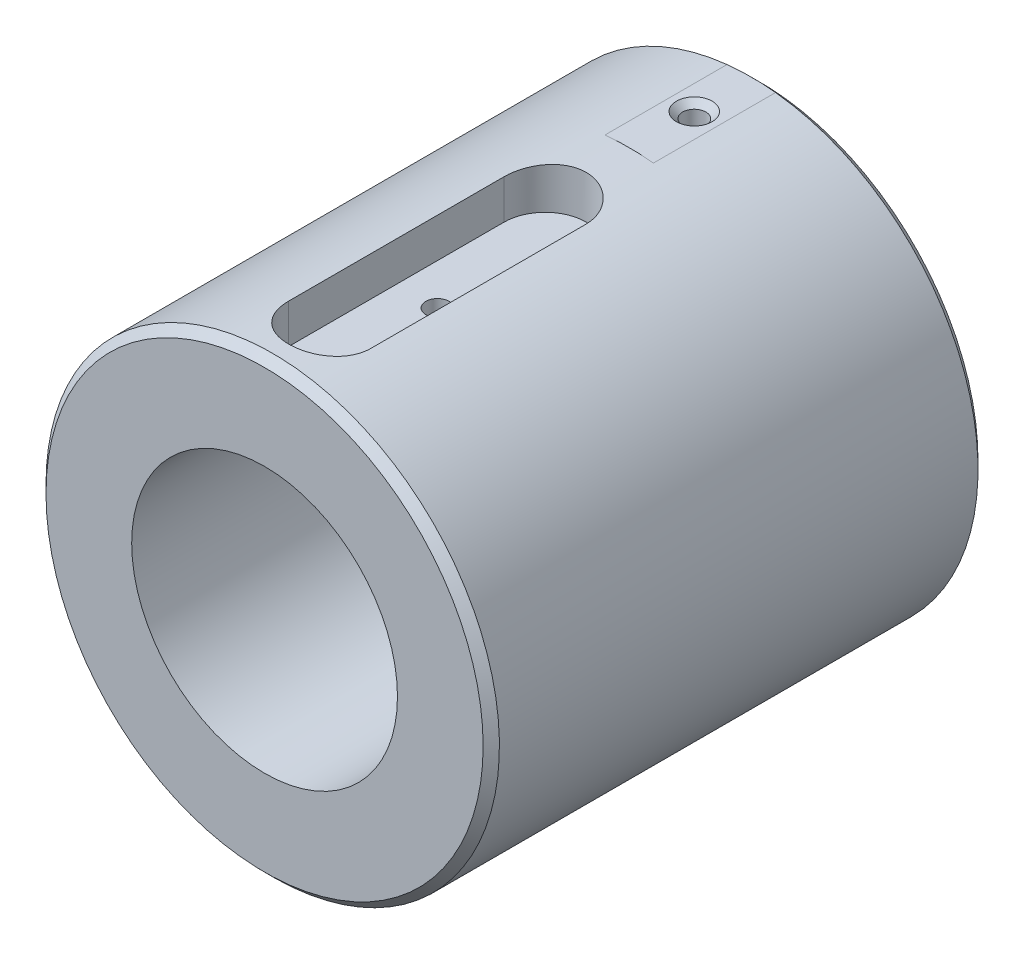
ISO-10303-21;
HEADER;
FILE_DESCRIPTION(('STEP AP214'),'2;1');
FILE_NAME('part.step','',(''),(''),'','','');
FILE_SCHEMA(('AUTOMOTIVE_DESIGN { 1 0 10303 214 1 1 1 1 }'));
ENDSEC;
DATA;
#1=APPLICATION_CONTEXT('core data for automotive mechanical design processes');
#2=APPLICATION_PROTOCOL_DEFINITION('international standard','automotive_design',2000,#1);
#3=PRODUCT_CONTEXT('',#1,'mechanical');
#4=PRODUCT('Part','Part','',(#3));
#5=PRODUCT_RELATED_PRODUCT_CATEGORY('part','',(#4));
#6=PRODUCT_DEFINITION_FORMATION('','',#4);
#7=PRODUCT_DEFINITION_CONTEXT('part definition',#1,'design');
#8=PRODUCT_DEFINITION('design','',#6,#7);
#9=PRODUCT_DEFINITION_SHAPE('','',#8);
#10=(LENGTH_UNIT() NAMED_UNIT(*) SI_UNIT(.MILLI.,.METRE.));
#11=(NAMED_UNIT(*) PLANE_ANGLE_UNIT() SI_UNIT($,.RADIAN.));
#12=(NAMED_UNIT(*) SI_UNIT($,.STERADIAN.) SOLID_ANGLE_UNIT());
#13=UNCERTAINTY_MEASURE_WITH_UNIT(LENGTH_MEASURE(1.E-05),#10,'distance_accuracy_value','');
#14=(GEOMETRIC_REPRESENTATION_CONTEXT(3) GLOBAL_UNCERTAINTY_ASSIGNED_CONTEXT((#13)) GLOBAL_UNIT_ASSIGNED_CONTEXT((#10,
#11,#12)) REPRESENTATION_CONTEXT('',''));
#15=CARTESIAN_POINT('',(0.,0.,0.));
#16=DIRECTION('',(0.,0.,1.));
#17=DIRECTION('',(1.,0.,0.));
#18=AXIS2_PLACEMENT_3D('',#15,#16,#17);
#19=CARTESIAN_POINT('',(0.,0.,0.));
#20=DIRECTION('',(0.,0.,1.));
#21=DIRECTION('',(1.,0.,0.));
#22=AXIS2_PLACEMENT_3D('',#19,#20,#21);
#23=CYLINDRICAL_SURFACE('',#22,22.098);
#24=CARTESIAN_POINT('',(0.,0.,33.15335));
#25=DIRECTION('',(0.,0.,-1.));
#26=DIRECTION('',(-1.,0.,0.));
#27=AXIS2_PLACEMENT_3D('',#24,#25,#26);
#28=CIRCLE('',#27,22.098);
#29=CARTESIAN_POINT('',(-22.098,0.,33.15335));
#30=VERTEX_POINT('',#29);
#31=EDGE_CURVE('E201',#30,#30,#28,.T.);
#32=ORIENTED_EDGE('',*,*,#31,.T.);
#33=EDGE_LOOP('',(#32));
#34=FACE_BOUND('',#33,.T.);
#35=DIRECTION('',(0.,0.,1.));
#36=VECTOR('',#35,1.);
#37=CARTESIAN_POINT('',(-2.3657478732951,21.971,0.));
#38=LINE('',#37,#36);
#39=CARTESIAN_POINT('',(-2.3657478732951,21.971,-1.5875));
#40=VERTEX_POINT('',#39);
#41=CARTESIAN_POINT('',(-2.3657478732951,21.971,-13.49375));
#42=VERTEX_POINT('',#41);
#43=EDGE_CURVE('E171',#40,#42,#38,.F.);
#44=ORIENTED_EDGE('',*,*,#43,.T.);
#45=CARTESIAN_POINT('',(0.,0.,-13.49375));
#46=DIRECTION('',(0.,0.,1.));
#47=DIRECTION('',(1.,0.,0.));
#48=AXIS2_PLACEMENT_3D('',#45,#46,#47);
#49=CIRCLE('',#48,22.098);
#50=CARTESIAN_POINT('',(2.3657478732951,21.971,-13.49375));
#51=VERTEX_POINT('',#50);
#52=EDGE_CURVE('E204',#42,#51,#49,.T.);
#53=ORIENTED_EDGE('',*,*,#52,.T.);
#54=DIRECTION('',(0.,0.,1.));
#55=VECTOR('',#54,1.);
#56=CARTESIAN_POINT('',(2.3657478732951,21.971,0.));
#57=LINE('',#56,#55);
#58=CARTESIAN_POINT('',(2.36574787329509,21.971,-1.5875));
#59=VERTEX_POINT('',#58);
#60=EDGE_CURVE('E179',#51,#59,#57,.T.);
#61=ORIENTED_EDGE('',*,*,#60,.T.);
#62=CARTESIAN_POINT('',(0.,0.,-1.5875));
#63=DIRECTION('',(0.,0.,1.));
#64=DIRECTION('',(1.,0.,0.));
#65=AXIS2_PLACEMENT_3D('',#62,#63,#64);
#66=CIRCLE('',#65,22.098);
#67=EDGE_CURVE('E185',#59,#40,#66,.T.);
#68=ORIENTED_EDGE('',*,*,#67,.T.);
#69=EDGE_LOOP('',(#44,#53,#61,#68));
#70=FACE_BOUND('',#69,.T.);
#71=CARTESIAN_POINT('',(-4.,21.7329612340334,27.5971));
#72=CARTESIAN_POINT('',(-4.00001184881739,21.7329525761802,27.7086207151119));
#73=CARTESIAN_POINT('',(-3.9953362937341,21.7338194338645,27.8201350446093));
#74=CARTESIAN_POINT('',(-3.97670224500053,21.7372401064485,28.0423474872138));
#75=CARTESIAN_POINT('',(-3.96274476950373,21.7397937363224,28.1530456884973));
#76=CARTESIAN_POINT('',(-3.92566418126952,21.746519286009,28.3726963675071));
#77=CARTESIAN_POINT('',(-3.90255367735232,21.7506889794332,28.4816510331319));
#78=CARTESIAN_POINT('',(-3.84736860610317,21.7605178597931,28.6971659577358));
#79=CARTESIAN_POINT('',(-3.81529402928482,21.766177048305,28.8037262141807));
#80=CARTESIAN_POINT('',(-3.7059320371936,21.7851607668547,29.1187316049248));
#81=CARTESIAN_POINT('',(-3.6154793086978,21.8004966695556,29.3226604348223));
#82=CARTESIAN_POINT('',(-3.40222470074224,21.8347900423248,29.7123507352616));
#83=CARTESIAN_POINT('',(-3.27942120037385,21.8537476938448,29.8981112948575));
#84=CARTESIAN_POINT('',(-3.00341675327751,21.8933935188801,30.2484570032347));
#85=CARTESIAN_POINT('',(-2.84991627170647,21.9140974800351,30.4128048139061));
#86=CARTESIAN_POINT('',(-2.51751489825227,21.9547650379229,30.7135687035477));
#87=CARTESIAN_POINT('',(-2.33861010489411,21.9747285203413,30.8499804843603));
#88=CARTESIAN_POINT('',(-1.95891823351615,22.0118338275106,31.091904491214));
#89=CARTESIAN_POINT('',(-1.75798548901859,22.0289547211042,31.1971916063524));
#90=CARTESIAN_POINT('',(-1.34093414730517,22.0582669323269,31.3724200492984));
#91=CARTESIAN_POINT('',(-1.12481756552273,22.0704589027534,31.4423660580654));
#92=CARTESIAN_POINT('',(-0.686007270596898,22.0884284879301,31.5441968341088));
#93=CARTESIAN_POINT('',(-0.463410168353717,22.0942741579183,31.5764857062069));
#94=CARTESIAN_POINT('',(-0.0158811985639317,22.0991268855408,31.6033438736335));
#95=CARTESIAN_POINT('',(0.20905053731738,22.0981343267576,31.5979152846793));
#96=CARTESIAN_POINT('',(0.652083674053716,22.0894755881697,31.5498030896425));
#97=CARTESIAN_POINT('',(0.870234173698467,22.0818875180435,31.5075555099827));
#98=CARTESIAN_POINT('',(1.29629641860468,22.0609778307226,31.3876928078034));
#99=CARTESIAN_POINT('',(1.50420787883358,22.0476560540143,31.3100767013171));
#100=CARTESIAN_POINT('',(1.90516913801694,22.0166443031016,31.1212601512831));
#101=CARTESIAN_POINT('',(2.09813392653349,21.9989314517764,31.0098831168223));
#102=CARTESIAN_POINT('',(2.46279445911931,21.9610998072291,30.7568302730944));
#103=CARTESIAN_POINT('',(2.63448892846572,21.9409808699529,30.6151526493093));
#104=CARTESIAN_POINT('',(2.95428863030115,21.900232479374,30.3031696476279));
#105=CARTESIAN_POINT('',(3.10202484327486,21.8795998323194,30.1324868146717));
#106=CARTESIAN_POINT('',(3.36690779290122,21.8404107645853,29.7684010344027));
#107=CARTESIAN_POINT('',(3.48404592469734,21.8218549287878,29.5749917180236));
#108=CARTESIAN_POINT('',(3.63423624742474,21.797167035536,29.2719554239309));
#109=CARTESIAN_POINT('',(3.68009894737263,21.7894523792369,29.1686164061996));
#110=CARTESIAN_POINT('',(3.76293797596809,21.7752996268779,28.9583640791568));
#111=CARTESIAN_POINT('',(3.79991775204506,21.7688610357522,28.8514521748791));
#112=CARTESIAN_POINT('',(3.86466935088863,21.7574588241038,28.6349311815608));
#113=CARTESIAN_POINT('',(3.89245082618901,21.7524936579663,28.5253250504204));
#114=CARTESIAN_POINT('',(3.93863573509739,21.7441786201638,28.3041373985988));
#115=CARTESIAN_POINT('',(3.95704365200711,21.7408279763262,28.1925568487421));
#116=CARTESIAN_POINT('',(3.98045962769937,21.7365508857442,28.0001798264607));
#117=CARTESIAN_POINT('',(3.98779096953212,21.7352057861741,27.9196674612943));
#118=CARTESIAN_POINT('',(3.99755823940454,21.7334106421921,27.7584726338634));
#119=CARTESIAN_POINT('',(4.00000239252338,21.7329590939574,27.6777906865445));
#120=CARTESIAN_POINT('',(4.,21.7329612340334,27.5971));
#121=B_SPLINE_CURVE_WITH_KNOTS('',3,(#71,#72,#73,#74,#75,#76,#77,#78,#79,#80,#81,#82,#83,#84,
#85,#86,#87,#88,#89,#90,#91,#92,#93,#94,#95,#96,#97,#98,#99,#100,#101,#102,#103,#104,#105,#106,
#107,#108,#109,#110,#111,#112,#113,#114,#115,#116,#117,#118,#119,#120),.UNSPECIFIED.,.F.,.F.,(4,
2,2,2,2,2,2,2,2,2,2,2,2,2,2,2,2,2,2,2,2,2,2,2,4),(0.,0.334449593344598,0.668862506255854,
1.00281633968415,1.3367705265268,2.00420066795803,2.67166425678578,3.34599001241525,
4.02041944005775,4.69961364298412,5.37871786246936,6.05046542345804,6.7221753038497,
7.38603696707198,8.04991710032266,8.71733148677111,9.3847858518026,10.061704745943,
10.7388138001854,11.0784410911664,11.417936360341,11.7570742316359,12.0960497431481,
12.3384747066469,12.5804913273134),.UNSPECIFIED.);
#122=CARTESIAN_POINT('',(-4.,21.7329612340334,27.5971));
#123=VERTEX_POINT('',#122);
#124=CARTESIAN_POINT('',(4.,21.7329612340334,27.5971));
#125=VERTEX_POINT('',#124);
#126=EDGE_CURVE('E189',#123,#125,#121,.T.);
#127=ORIENTED_EDGE('',*,*,#126,.F.);
#128=DIRECTION('',(0.,0.,1.));
#129=VECTOR('',#128,1.);
#130=CARTESIAN_POINT('',(-4.,21.7329612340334,0.));
#131=LINE('',#130,#129);
#132=CARTESIAN_POINT('',(-4.,21.7329612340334,6.59709999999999));
#133=VERTEX_POINT('',#132);
#134=EDGE_CURVE('E282',#133,#123,#131,.T.);
#135=ORIENTED_EDGE('',*,*,#134,.F.);
#136=CARTESIAN_POINT('',(4.,21.7329612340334,6.59709999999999));
#137=CARTESIAN_POINT('',(4.00001184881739,21.7329525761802,6.48557928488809));
#138=CARTESIAN_POINT('',(3.9953362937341,21.7338194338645,6.37406495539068));
#139=CARTESIAN_POINT('',(3.97670224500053,21.7372401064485,6.15185251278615));
#140=CARTESIAN_POINT('',(3.96274476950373,21.7397937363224,6.04115431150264));
#141=CARTESIAN_POINT('',(3.92566418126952,21.746519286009,5.82150363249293));
#142=CARTESIAN_POINT('',(3.90255367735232,21.7506889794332,5.71254896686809));
#143=CARTESIAN_POINT('',(3.84736860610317,21.7605178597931,5.49703404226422));
#144=CARTESIAN_POINT('',(3.81529402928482,21.766177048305,5.39047378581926));
#145=CARTESIAN_POINT('',(3.7059320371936,21.7851607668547,5.07546839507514));
#146=CARTESIAN_POINT('',(3.6154793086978,21.8004966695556,4.87153956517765));
#147=CARTESIAN_POINT('',(3.40222470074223,21.8347900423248,4.4818492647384));
#148=CARTESIAN_POINT('',(3.27942120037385,21.8537476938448,4.29608870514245));
#149=CARTESIAN_POINT('',(3.00341675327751,21.8933935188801,3.9457429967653));
#150=CARTESIAN_POINT('',(2.84991627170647,21.9140974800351,3.78139518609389));
#151=CARTESIAN_POINT('',(2.51751489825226,21.9547650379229,3.48063129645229));
#152=CARTESIAN_POINT('',(2.33861010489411,21.9747285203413,3.34421951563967));
#153=CARTESIAN_POINT('',(1.95891823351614,22.0118338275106,3.10229550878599));
#154=CARTESIAN_POINT('',(1.75798548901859,22.0289547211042,2.9970083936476));
#155=CARTESIAN_POINT('',(1.34093414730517,22.0582669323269,2.82177995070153));
#156=CARTESIAN_POINT('',(1.12481756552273,22.0704589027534,2.7518339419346));
#157=CARTESIAN_POINT('',(0.686007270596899,22.0884284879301,2.65000316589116));
#158=CARTESIAN_POINT('',(0.463410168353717,22.0942741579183,2.61771429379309));
#159=CARTESIAN_POINT('',(0.0158811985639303,22.0991268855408,2.59085612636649));
#160=CARTESIAN_POINT('',(-0.209050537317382,22.0981343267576,2.59628471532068));
#161=CARTESIAN_POINT('',(-0.652083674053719,22.0894755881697,2.64439691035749));
#162=CARTESIAN_POINT('',(-0.870234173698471,22.0818875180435,2.68664449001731));
#163=CARTESIAN_POINT('',(-1.29629641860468,22.0609778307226,2.80650719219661));
#164=CARTESIAN_POINT('',(-1.50420787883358,22.0476560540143,2.88412329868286));
#165=CARTESIAN_POINT('',(-1.90516913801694,22.0166443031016,3.07293984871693));
#166=CARTESIAN_POINT('',(-2.0981339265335,21.9989314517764,3.1843168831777));
#167=CARTESIAN_POINT('',(-2.46279445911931,21.9610998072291,3.43736972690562));
#168=CARTESIAN_POINT('',(-2.63448892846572,21.9409808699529,3.5790473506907));
#169=CARTESIAN_POINT('',(-2.95428863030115,21.900232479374,3.89103035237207));
#170=CARTESIAN_POINT('',(-3.10202484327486,21.8795998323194,4.06171318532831));
#171=CARTESIAN_POINT('',(-3.36690779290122,21.8404107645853,4.42579896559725));
#172=CARTESIAN_POINT('',(-3.48404592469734,21.8218549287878,4.61920828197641));
#173=CARTESIAN_POINT('',(-3.63423624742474,21.797167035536,4.92224457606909));
#174=CARTESIAN_POINT('',(-3.68009894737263,21.7894523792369,5.0255835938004));
#175=CARTESIAN_POINT('',(-3.76293797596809,21.7752996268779,5.23583592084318));
#176=CARTESIAN_POINT('',(-3.79991775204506,21.7688610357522,5.34274782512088));
#177=CARTESIAN_POINT('',(-3.86466935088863,21.7574588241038,5.55926881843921));
#178=CARTESIAN_POINT('',(-3.89245082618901,21.7524936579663,5.66887494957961));
#179=CARTESIAN_POINT('',(-3.93863573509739,21.7441786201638,5.89006260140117));
#180=CARTESIAN_POINT('',(-3.95704365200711,21.7408279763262,6.00164315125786));
#181=CARTESIAN_POINT('',(-3.98045962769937,21.7365508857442,6.19402017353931));
#182=CARTESIAN_POINT('',(-3.98779096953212,21.7352057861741,6.27453253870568));
#183=CARTESIAN_POINT('',(-3.99755823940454,21.7334106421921,6.43572736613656));
#184=CARTESIAN_POINT('',(-4.00000239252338,21.7329590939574,6.51640931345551));
#185=CARTESIAN_POINT('',(-4.,21.7329612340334,6.59709999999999));
#186=B_SPLINE_CURVE_WITH_KNOTS('',3,(#136,#137,#138,#139,#140,#141,#142,#143,#144,#145,#146,
#147,#148,#149,#150,#151,#152,#153,#154,#155,#156,#157,#158,#159,#160,#161,#162,#163,#164,#165,
#166,#167,#168,#169,#170,#171,#172,#173,#174,#175,#176,#177,#178,#179,#180,#181,#182,#183,#184,
#185),.UNSPECIFIED.,.F.,.F.,(4,2,2,2,2,2,2,2,2,2,2,2,2,2,2,2,2,2,2,2,2,2,2,2,4),(0.,
0.334449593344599,0.668862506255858,1.00281633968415,1.3367705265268,2.00420066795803,
2.67166425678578,3.34599001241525,4.02041944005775,4.69961364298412,5.37871786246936,
6.05046542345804,6.7221753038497,7.38603696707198,8.04991710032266,8.71733148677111,
9.38478585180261,10.061704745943,10.7388138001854,11.0784410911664,11.417936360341,
11.7570742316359,12.0960497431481,12.3384747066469,12.5804913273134),.UNSPECIFIED.);
#187=CARTESIAN_POINT('',(4.,21.7329612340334,6.59709999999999));
#188=VERTEX_POINT('',#187);
#189=EDGE_CURVE('E275',#188,#133,#186,.T.);
#190=ORIENTED_EDGE('',*,*,#189,.F.);
#191=DIRECTION('',(0.,0.,1.));
#192=VECTOR('',#191,1.);
#193=CARTESIAN_POINT('',(4.,21.7329612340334,0.));
#194=LINE('',#193,#192);
#195=EDGE_CURVE('E194',#125,#188,#194,.F.);
#196=ORIENTED_EDGE('',*,*,#195,.F.);
#197=EDGE_LOOP('',(#127,#135,#190,#196));
#198=FACE_BOUND('',#197,.T.);
#199=ADVANCED_FACE('F119',(#34,#70,#198),#23,.T.);
#200=CARTESIAN_POINT('',(0.,15.875,-14.2875));
#201=DIRECTION('',(0.,0.,1.));
#202=DIRECTION('',(1.,0.,0.));
#203=AXIS2_PLACEMENT_3D('',#200,#201,#202);
#204=PLANE('',#203);
#205=CARTESIAN_POINT('',(0.,0.,-14.2875));
#206=DIRECTION('',(0.,0.,1.));
#207=DIRECTION('',(1.,0.,0.));
#208=AXIS2_PLACEMENT_3D('',#205,#206,#207);
#209=CIRCLE('',#208,21.30425);
#210=CARTESIAN_POINT('',(-2.28077129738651,21.1818117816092,-14.2875));
#211=VERTEX_POINT('',#210);
#212=EDGE_CURVE('E127',#211,#211,#209,.F.);
#213=ORIENTED_EDGE('',*,*,#212,.T.);
#214=EDGE_LOOP('',(#213));
#215=FACE_BOUND('',#214,.T.);
#216=CARTESIAN_POINT('',(0.,0.,-14.2875));
#217=DIRECTION('',(0.,0.,1.));
#218=DIRECTION('',(1.,0.,0.));
#219=AXIS2_PLACEMENT_3D('',#216,#217,#218);
#220=CIRCLE('',#219,16.637);
#221=CARTESIAN_POINT('',(16.637,0.,-14.2875));
#222=VERTEX_POINT('',#221);
#223=EDGE_CURVE('E188',#222,#222,#220,.T.);
#224=ORIENTED_EDGE('',*,*,#223,.T.);
#225=EDGE_LOOP('',(#224));
#226=FACE_BOUND('',#225,.T.);
#227=ADVANCED_FACE('F267',(#215,#226),#204,.F.);
#228=CARTESIAN_POINT('',(0.,22.098,33.9471));
#229=DIRECTION('',(0.,0.,-1.));
#230=DIRECTION('',(-1.,0.,0.));
#231=AXIS2_PLACEMENT_3D('',#228,#229,#230);
#232=PLANE('',#231);
#233=CARTESIAN_POINT('',(0.,0.,33.9471));
#234=DIRECTION('',(0.,0.,-1.));
#235=DIRECTION('',(-1.,0.,0.));
#236=AXIS2_PLACEMENT_3D('',#233,#234,#235);
#237=CIRCLE('',#236,21.30425);
#238=CARTESIAN_POINT('',(-21.30425,0.,33.9471));
#239=VERTEX_POINT('',#238);
#240=EDGE_CURVE('E14',#239,#239,#237,.F.);
#241=ORIENTED_EDGE('',*,*,#240,.T.);
#242=EDGE_LOOP('',(#241));
#243=FACE_BOUND('',#242,.T.);
#244=CARTESIAN_POINT('',(0.,0.,33.9471));
#245=DIRECTION('',(0.,0.,1.));
#246=DIRECTION('',(1.,0.,0.));
#247=AXIS2_PLACEMENT_3D('',#244,#245,#246);
#248=CIRCLE('',#247,12.954);
#249=CARTESIAN_POINT('',(12.954,0.,33.9471));
#250=VERTEX_POINT('',#249);
#251=EDGE_CURVE('E315',#250,#250,#248,.T.);
#252=ORIENTED_EDGE('',*,*,#251,.F.);
#253=EDGE_LOOP('',(#252));
#254=FACE_BOUND('',#253,.T.);
#255=ADVANCED_FACE('F264',(#243,#254),#232,.F.);
#256=CARTESIAN_POINT('',(0.,0.,0.));
#257=DIRECTION('',(0.,0.,1.));
#258=DIRECTION('',(1.,0.,0.));
#259=AXIS2_PLACEMENT_3D('',#256,#257,#258);
#260=CYLINDRICAL_SURFACE('',#259,12.954);
#261=CARTESIAN_POINT('',(0.,12.954,18.2274));
#262=CARTESIAN_POINT('',(0.0633601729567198,12.9539993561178,18.2273972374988));
#263=CARTESIAN_POINT('',(0.12676320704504,12.9535301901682,18.2220544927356));
#264=CARTESIAN_POINT('',(0.251814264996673,12.9517037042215,18.2008203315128));
#265=CARTESIAN_POINT('',(0.313460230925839,12.9503453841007,18.18491703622));
#266=CARTESIAN_POINT('',(0.43316798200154,12.946894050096,18.1430258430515));
#267=CARTESIAN_POINT('',(0.491231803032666,12.9448014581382,18.1170437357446));
#268=CARTESIAN_POINT('',(0.602160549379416,12.9401161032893,18.0557430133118));
#269=CARTESIAN_POINT('',(0.655026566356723,12.937523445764,18.0204263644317));
#270=CARTESIAN_POINT('',(0.754219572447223,12.9321207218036,17.941353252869));
#271=CARTESIAN_POINT('',(0.800530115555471,12.9293101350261,17.897576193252));
#272=CARTESIAN_POINT('',(0.885156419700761,12.9237926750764,17.802868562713));
#273=CARTESIAN_POINT('',(0.92347182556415,12.9210858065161,17.7519376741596));
#274=CARTESIAN_POINT('',(0.991076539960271,12.916076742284,17.6442677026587));
#275=CARTESIAN_POINT('',(1.02035128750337,12.913775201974,17.5875194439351));
#276=CARTESIAN_POINT('',(1.06895068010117,12.9098434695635,17.4698894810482));
#277=CARTESIAN_POINT('',(1.08827551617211,12.908213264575,17.4090078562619));
#278=CARTESIAN_POINT('',(1.11637855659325,12.9058132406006,17.2850049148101));
#279=CARTESIAN_POINT('',(1.12518367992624,12.9050412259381,17.2218897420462));
#280=CARTESIAN_POINT('',(1.13208052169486,12.9044380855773,17.0950729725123));
#281=CARTESIAN_POINT('',(1.13017245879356,12.9046069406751,17.0313713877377));
#282=CARTESIAN_POINT('',(1.11571932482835,12.9058644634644,16.9053747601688));
#283=CARTESIAN_POINT('',(1.10320353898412,12.9069505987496,16.843076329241));
#284=CARTESIAN_POINT('',(1.06793574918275,12.9099163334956,16.7214677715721));
#285=CARTESIAN_POINT('',(1.04518363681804,12.9117959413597,16.6621576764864));
#286=CARTESIAN_POINT('',(0.990056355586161,12.9161397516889,16.5481162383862));
#287=CARTESIAN_POINT('',(0.957668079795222,12.9186047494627,16.4933912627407));
#288=CARTESIAN_POINT('',(0.884197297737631,12.92384087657,16.3901431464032));
#289=CARTESIAN_POINT('',(0.843114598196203,12.9266120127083,16.3416201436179));
#290=CARTESIAN_POINT('',(0.753257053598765,12.9321594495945,16.251983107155));
#291=CARTESIAN_POINT('',(0.704456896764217,12.9349357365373,16.2108944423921));
#292=CARTESIAN_POINT('',(0.600637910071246,12.9401718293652,16.1374886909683));
#293=CARTESIAN_POINT('',(0.545619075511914,12.9426316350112,16.1051716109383));
#294=CARTESIAN_POINT('',(0.430907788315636,12.9469581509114,16.0502278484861));
#295=CARTESIAN_POINT('',(0.371214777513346,12.9488247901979,16.027602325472));
#296=CARTESIAN_POINT('',(0.248857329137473,12.9517538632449,15.9927018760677));
#297=CARTESIAN_POINT('',(0.186192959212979,12.952816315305,15.9804267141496));
#298=CARTESIAN_POINT('',(0.0598914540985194,12.9540149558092,15.9666073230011));
#299=CARTESIAN_POINT('',(-0.00374182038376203,12.9541541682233,15.9650280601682));
#300=CARTESIAN_POINT('',(-0.13036796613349,12.953498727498,15.9725534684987));
#301=CARTESIAN_POINT('',(-0.19336084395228,12.9527040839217,15.9816580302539));
#302=CARTESIAN_POINT('',(-0.31681789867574,12.9502722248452,16.0102635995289));
#303=CARTESIAN_POINT('',(-0.377285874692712,12.9486363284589,16.0297483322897));
#304=CARTESIAN_POINT('',(-0.494094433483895,12.9447056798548,16.0785444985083));
#305=CARTESIAN_POINT('',(-0.550434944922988,12.9424109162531,16.1078561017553));
#306=CARTESIAN_POINT('',(-0.657548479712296,12.9374121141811,16.1755617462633));
#307=CARTESIAN_POINT('',(-0.708306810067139,12.9347070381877,16.2139789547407));
#308=CARTESIAN_POINT('',(-0.802666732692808,12.9291948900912,16.2987718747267));
#309=CARTESIAN_POINT('',(-0.846268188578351,12.9263878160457,16.3451477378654));
#310=CARTESIAN_POINT('',(-0.925197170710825,12.9209790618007,16.4446937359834));
#311=CARTESIAN_POINT('',(-0.96050180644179,12.9183779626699,16.4978820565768));
#312=CARTESIAN_POINT('',(-1.02167793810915,12.9136840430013,16.6094528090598));
#313=CARTESIAN_POINT('',(-1.04754953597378,12.9115912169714,16.6678351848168));
#314=CARTESIAN_POINT('',(-1.08908634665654,12.9081541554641,16.788056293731));
#315=CARTESIAN_POINT('',(-1.10476548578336,12.9068088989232,16.8498901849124));
#316=CARTESIAN_POINT('',(-1.12551761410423,12.9050159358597,16.9753251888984));
#317=CARTESIAN_POINT('',(-1.13059082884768,12.90456821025,17.0389262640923));
#318=CARTESIAN_POINT('',(-1.12998438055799,12.9046213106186,17.1658627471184));
#319=CARTESIAN_POINT('',(-1.12434068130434,12.9051189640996,17.2291983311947));
#320=CARTESIAN_POINT('',(-1.10253569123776,12.9070000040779,17.3540183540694));
#321=CARTESIAN_POINT('',(-1.08637438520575,12.9083833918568,17.415502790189));
#322=CARTESIAN_POINT('',(-1.04400223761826,12.9118791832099,17.5348769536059));
#323=CARTESIAN_POINT('',(-1.0177921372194,12.9139915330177,17.5927669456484));
#324=CARTESIAN_POINT('',(-0.956070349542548,12.9187073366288,17.7033310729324));
#325=CARTESIAN_POINT('',(-0.920558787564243,12.9213107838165,17.7560052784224));
#326=CARTESIAN_POINT('',(-0.841106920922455,12.9267258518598,17.8548267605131));
#327=CARTESIAN_POINT('',(-0.797139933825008,12.9295381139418,17.9009525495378));
#328=CARTESIAN_POINT('',(-0.702074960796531,12.935048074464,17.9851892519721));
#329=CARTESIAN_POINT('',(-0.650975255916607,12.9377457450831,18.0232982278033));
#330=CARTESIAN_POINT('',(-0.542987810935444,12.9427279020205,18.0904758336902));
#331=CARTESIAN_POINT('',(-0.486088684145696,12.9450115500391,18.1195262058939));
#332=CARTESIAN_POINT('',(-0.3682386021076,12.9488987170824,18.1676232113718));
#333=CARTESIAN_POINT('',(-0.307292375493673,12.9505030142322,18.1866812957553));
#334=CARTESIAN_POINT('',(-0.204991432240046,12.9524407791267,18.209421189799));
#335=CARTESIAN_POINT('',(-0.164293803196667,12.9530228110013,18.2161542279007));
#336=CARTESIAN_POINT('',(-0.0824034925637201,12.9538026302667,18.2251445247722));
#337=CARTESIAN_POINT('',(-0.0412108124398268,12.9540004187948,18.2274017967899));
#338=CARTESIAN_POINT('',(0.,12.954,18.2274));
#339=B_SPLINE_CURVE_WITH_KNOTS('',3,(#261,#262,#263,#264,#265,#266,#267,#268,#269,#270,#271,
#272,#273,#274,#275,#276,#277,#278,#279,#280,#281,#282,#283,#284,#285,#286,#287,#288,#289,#290,
#291,#292,#293,#294,#295,#296,#297,#298,#299,#300,#301,#302,#303,#304,#305,#306,#307,#308,#309,
#310,#311,#312,#313,#314,#315,#316,#317,#318,#319,#320,#321,#322,#323,#324,#325,#326,#327,#328,
#329,#330,#331,#332,#333,#334,#335,#336,#337,#338),.UNSPECIFIED.,.T.,.F.,(4,2,2,2,2,2,2,2,2,2,2,
2,2,2,2,2,2,2,2,2,2,2,2,2,2,2,2,2,2,2,2,2,2,2,2,2,2,2,4),(0.,0.189930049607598,
0.380074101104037,0.570109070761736,0.760104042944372,0.950567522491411,1.14103946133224,
1.33181659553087,1.52259006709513,1.71287431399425,1.90315467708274,2.09291142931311,
2.28267019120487,2.47268824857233,2.66271053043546,2.85336949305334,3.04402859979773,
3.23471050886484,3.42538807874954,3.61544079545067,3.80549156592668,3.99524523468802,
4.18500218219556,4.37524720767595,4.56549585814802,4.75626338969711,4.94702885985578,
5.1375331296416,5.32803334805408,5.51789541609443,5.70775775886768,5.89760610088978,
6.08745188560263,6.27790689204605,6.4684078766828,6.6592903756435,6.84995364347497,
6.97348857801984,7.09702314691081),.UNSPECIFIED.);
#340=CARTESIAN_POINT('',(0.,12.954,18.2274));
#341=VERTEX_POINT('',#340);
#342=EDGE_CURVE('E345',#341,#341,#339,.T.);
#343=ORIENTED_EDGE('',*,*,#342,.T.);
#344=EDGE_LOOP('',(#343));
#345=FACE_BOUND('',#344,.T.);
#346=CARTESIAN_POINT('',(0.,0.,0.));
#347=DIRECTION('',(0.,0.,1.));
#348=DIRECTION('',(1.,0.,0.));
#349=AXIS2_PLACEMENT_3D('',#346,#347,#348);
#350=CIRCLE('',#349,12.954);
#351=CARTESIAN_POINT('',(12.954,0.,0.));
#352=VERTEX_POINT('',#351);
#353=EDGE_CURVE('E317',#352,#352,#350,.T.);
#354=ORIENTED_EDGE('',*,*,#353,.F.);
#355=EDGE_LOOP('',(#354));
#356=FACE_BOUND('',#355,.T.);
#357=ORIENTED_EDGE('',*,*,#251,.T.);
#358=EDGE_LOOP('',(#357));
#359=FACE_BOUND('',#358,.T.);
#360=ADVANCED_FACE('F260',(#345,#356,#359),#260,.F.);
#361=CARTESIAN_POINT('',(0.,12.954,0.));
#362=DIRECTION('',(0.,0.,1.));
#363=DIRECTION('',(1.,0.,0.));
#364=AXIS2_PLACEMENT_3D('',#361,#362,#363);
#365=PLANE('',#364);
#366=CARTESIAN_POINT('',(0.,0.,0.));
#367=DIRECTION('',(0.,0.,1.));
#368=DIRECTION('',(1.,0.,0.));
#369=AXIS2_PLACEMENT_3D('',#366,#367,#368);
#370=CIRCLE('',#369,17.5895);
#371=CARTESIAN_POINT('',(17.5895,0.,0.));
#372=VERTEX_POINT('',#371);
#373=EDGE_CURVE('E321',#372,#372,#370,.T.);
#374=ORIENTED_EDGE('',*,*,#373,.F.);
#375=EDGE_LOOP('',(#374));
#376=FACE_BOUND('',#375,.T.);
#377=ORIENTED_EDGE('',*,*,#353,.T.);
#378=EDGE_LOOP('',(#377));
#379=FACE_BOUND('',#378,.T.);
#380=ADVANCED_FACE('F256',(#376,#379),#365,.F.);
#381=CARTESIAN_POINT('',(0.,0.,0.));
#382=DIRECTION('',(0.,0.,1.));
#383=DIRECTION('',(1.,0.,0.));
#384=AXIS2_PLACEMENT_3D('',#381,#382,#383);
#385=CYLINDRICAL_SURFACE('',#384,17.5895);
#386=CARTESIAN_POINT('',(0.,0.,-3.175));
#387=DIRECTION('',(0.,0.,1.));
#388=DIRECTION('',(1.,0.,0.));
#389=AXIS2_PLACEMENT_3D('',#386,#387,#388);
#390=CIRCLE('',#389,17.5895);
#391=CARTESIAN_POINT('',(17.5895,0.,-3.175));
#392=VERTEX_POINT('',#391);
#393=EDGE_CURVE('E326',#392,#392,#390,.T.);
#394=ORIENTED_EDGE('',*,*,#393,.F.);
#395=EDGE_LOOP('',(#394));
#396=FACE_BOUND('',#395,.T.);
#397=ORIENTED_EDGE('',*,*,#373,.T.);
#398=EDGE_LOOP('',(#397));
#399=FACE_BOUND('',#398,.T.);
#400=ADVANCED_FACE('F252',(#396,#399),#385,.F.);
#401=CARTESIAN_POINT('',(0.,17.5895,-3.175));
#402=DIRECTION('',(0.,0.,-1.));
#403=DIRECTION('',(-1.,0.,0.));
#404=AXIS2_PLACEMENT_3D('',#401,#402,#403);
#405=PLANE('',#404);
#406=CARTESIAN_POINT('',(0.,0.,-3.175));
#407=DIRECTION('',(0.,0.,1.));
#408=DIRECTION('',(1.,0.,0.));
#409=AXIS2_PLACEMENT_3D('',#406,#407,#408);
#410=CIRCLE('',#409,15.875);
#411=CARTESIAN_POINT('',(15.875,0.,-3.175));
#412=VERTEX_POINT('',#411);
#413=EDGE_CURVE('E329',#412,#412,#410,.T.);
#414=ORIENTED_EDGE('',*,*,#413,.F.);
#415=EDGE_LOOP('',(#414));
#416=FACE_BOUND('',#415,.T.);
#417=ORIENTED_EDGE('',*,*,#393,.T.);
#418=EDGE_LOOP('',(#417));
#419=FACE_BOUND('',#418,.T.);
#420=ADVANCED_FACE('F246',(#416,#419),#405,.F.);
#421=CARTESIAN_POINT('',(0.,0.,0.));
#422=DIRECTION('',(0.,0.,1.));
#423=DIRECTION('',(1.,0.,0.));
#424=AXIS2_PLACEMENT_3D('',#421,#422,#423);
#425=CYLINDRICAL_SURFACE('',#424,15.875);
#426=CARTESIAN_POINT('',(0.,0.,-13.5255));
#427=DIRECTION('',(0.,0.,1.));
#428=DIRECTION('',(1.,0.,0.));
#429=AXIS2_PLACEMENT_3D('',#426,#427,#428);
#430=CIRCLE('',#429,15.875);
#431=CARTESIAN_POINT('',(15.875,0.,-13.5255));
#432=VERTEX_POINT('',#431);
#433=EDGE_CURVE('E192',#432,#432,#430,.F.);
#434=ORIENTED_EDGE('',*,*,#433,.T.);
#435=EDGE_LOOP('',(#434));
#436=FACE_BOUND('',#435,.T.);
#437=CARTESIAN_POINT('',(0.,15.875,-9.06779999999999));
#438=CARTESIAN_POINT('',(-0.0634032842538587,15.8749994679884,-9.06779721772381));
#439=CARTESIAN_POINT('',(-0.126850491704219,15.8746161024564,-9.06244723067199));
#440=CARTESIAN_POINT('',(-0.251991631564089,15.8731236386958,-9.0411826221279));
#441=CARTESIAN_POINT('',(-0.313683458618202,15.8720137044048,-9.0252558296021));
#442=CARTESIAN_POINT('',(-0.433483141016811,15.8691936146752,-8.983298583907));
#443=CARTESIAN_POINT('',(-0.491592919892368,15.8674837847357,-8.95727360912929));
#444=CARTESIAN_POINT('',(-0.602604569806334,15.8636559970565,-8.89586799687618));
#445=CARTESIAN_POINT('',(-0.655507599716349,15.8615381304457,-8.86048944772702));
#446=CARTESIAN_POINT('',(-0.754719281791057,15.8571276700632,-8.78130779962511));
#447=CARTESIAN_POINT('',(-0.801016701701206,15.8548347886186,-8.73749064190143));
#448=CARTESIAN_POINT('',(-0.885606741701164,15.8503351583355,-8.64270493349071));
#449=CARTESIAN_POINT('',(-0.923899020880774,15.8481284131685,-8.59173607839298));
#450=CARTESIAN_POINT('',(-0.991428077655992,15.8440476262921,-8.48402804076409));
#451=CARTESIAN_POINT('',(-1.02065526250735,15.8421739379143,-8.42728282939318));
#452=CARTESIAN_POINT('',(-1.06916315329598,15.8389743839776,-8.30967502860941));
#453=CARTESIAN_POINT('',(-1.08844399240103,15.8376485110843,-8.24881249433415));
#454=CARTESIAN_POINT('',(-1.11648001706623,15.8356969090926,-8.12480808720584));
#455=CARTESIAN_POINT('',(-1.12525314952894,15.8350699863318,-8.06167029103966));
#456=CARTESIAN_POINT('',(-1.13208014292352,15.834583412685,-7.93481537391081));
#457=CARTESIAN_POINT('',(-1.13013415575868,15.8347237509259,-7.87109826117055));
#458=CARTESIAN_POINT('',(-1.11559301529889,15.8357547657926,-7.74501596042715));
#459=CARTESIAN_POINT('',(-1.10301731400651,15.836644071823,-7.68264851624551));
#460=CARTESIAN_POINT('',(-1.06760391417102,15.8390706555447,-7.56091198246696));
#461=CARTESIAN_POINT('',(-1.0447661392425,15.8406079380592,-7.50154291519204));
#462=CARTESIAN_POINT('',(-0.9894549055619,15.8441588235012,-7.38742609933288));
#463=CARTESIAN_POINT('',(-0.956972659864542,15.8461728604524,-7.33268262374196));
#464=CARTESIAN_POINT('',(-0.883300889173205,15.8504498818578,-7.22941767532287));
#465=CARTESIAN_POINT('',(-0.842111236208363,15.8527128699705,-7.18089629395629));
#466=CARTESIAN_POINT('',(-0.752084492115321,15.8572388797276,-7.09133973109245));
#467=CARTESIAN_POINT('',(-0.703230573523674,15.8595018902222,-7.05032146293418));
#468=CARTESIAN_POINT('',(-0.599320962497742,15.863768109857,-6.97706606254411));
#469=CARTESIAN_POINT('',(-0.544265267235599,15.8657713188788,-6.94482893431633));
#470=CARTESIAN_POINT('',(-0.429504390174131,15.8692924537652,-6.89005219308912));
#471=CARTESIAN_POINT('',(-0.369798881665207,15.8708103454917,-6.86751326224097));
#472=CARTESIAN_POINT('',(-0.247437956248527,15.873189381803,-6.83278421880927));
#473=CARTESIAN_POINT('',(-0.184782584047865,15.8740505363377,-6.82059394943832));
#474=CARTESIAN_POINT('',(-0.0584471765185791,15.8750177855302,-6.80692931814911));
#475=CARTESIAN_POINT('',(0.00523031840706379,15.8751255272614,-6.80543158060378));
#476=CARTESIAN_POINT('',(0.131931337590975,15.8745781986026,-6.81313339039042));
#477=CARTESIAN_POINT('',(0.194954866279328,15.8739231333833,-6.82233286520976));
#478=CARTESIAN_POINT('',(0.318492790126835,15.8719249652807,-6.85114859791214));
#479=CARTESIAN_POINT('',(0.379009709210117,15.8705825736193,-6.87075408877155));
#480=CARTESIAN_POINT('',(0.495894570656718,15.8673606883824,-6.91981436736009));
#481=CARTESIAN_POINT('',(0.552262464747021,15.8654811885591,-6.94926926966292));
#482=CARTESIAN_POINT('',(0.659355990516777,15.8613919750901,-7.01725146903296));
#483=CARTESIAN_POINT('',(0.710071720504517,15.8591816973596,-7.05579432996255));
#484=CARTESIAN_POINT('',(0.804321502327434,15.8546814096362,-7.14083576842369));
#485=CARTESIAN_POINT('',(0.847855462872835,15.8523913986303,-7.18733444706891));
#486=CARTESIAN_POINT('',(0.92658550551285,15.8479849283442,-7.28706867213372));
#487=CARTESIAN_POINT('',(0.961766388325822,15.845868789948,-7.34031623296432));
#488=CARTESIAN_POINT('',(1.02268755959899,15.8420538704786,-7.45197656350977));
#489=CARTESIAN_POINT('',(1.04842792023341,15.8403550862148,-7.51038929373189));
#490=CARTESIAN_POINT('',(1.08971121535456,15.837568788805,-7.63066697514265));
#491=CARTESIAN_POINT('',(1.10526361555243,15.8364807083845,-7.69252866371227));
#492=CARTESIAN_POINT('',(1.1257603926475,15.8350369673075,-7.81799330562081));
#493=CARTESIAN_POINT('',(1.13070491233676,15.8346812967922,-7.8815962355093));
#494=CARTESIAN_POINT('',(1.12984410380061,15.8347427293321,-8.00858682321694));
#495=CARTESIAN_POINT('',(1.12406266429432,15.8351581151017,-8.07197464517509));
#496=CARTESIAN_POINT('',(1.10196369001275,15.8367112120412,-8.19687688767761));
#497=CARTESIAN_POINT('',(1.08564613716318,15.8378489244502,-8.25839130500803));
#498=CARTESIAN_POINT('',(1.04294379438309,15.8407180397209,-8.37780332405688));
#499=CARTESIAN_POINT('',(1.01655924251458,15.8424494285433,-8.43570101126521));
#500=CARTESIAN_POINT('',(0.954474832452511,15.84631079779,-8.54624841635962));
#501=CARTESIAN_POINT('',(0.918775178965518,15.8484407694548,-8.59889824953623));
#502=CARTESIAN_POINT('',(0.838984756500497,15.8528648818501,-8.69757717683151));
#503=CARTESIAN_POINT('',(0.794876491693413,15.8551593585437,-8.74359210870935));
#504=CARTESIAN_POINT('',(0.699548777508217,15.8596509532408,-8.82758166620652));
#505=CARTESIAN_POINT('',(0.648327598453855,15.8618480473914,-8.86555433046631));
#506=CARTESIAN_POINT('',(0.540154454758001,15.8659002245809,-8.93241805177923));
#507=CARTESIAN_POINT('',(0.483194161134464,15.8677547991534,-8.96129565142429));
#508=CARTESIAN_POINT('',(0.365260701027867,15.8709065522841,-9.00904124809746));
#509=CARTESIAN_POINT('',(0.304292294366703,15.8722043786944,-9.02792088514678));
#510=CARTESIAN_POINT('',(0.202463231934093,15.8737589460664,-9.05026533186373));
#511=CARTESIAN_POINT('',(0.162259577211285,15.874222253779,-9.05683223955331));
#512=CARTESIAN_POINT('',(0.0813766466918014,15.8748429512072,-9.06560046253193));
#513=CARTESIAN_POINT('',(0.0406973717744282,15.8750003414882,-9.06780178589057));
#514=CARTESIAN_POINT('',(0.,15.875,-9.06779999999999));
#515=B_SPLINE_CURVE_WITH_KNOTS('',3,(#437,#438,#439,#440,#441,#442,#443,#444,#445,#446,#447,
#448,#449,#450,#451,#452,#453,#454,#455,#456,#457,#458,#459,#460,#461,#462,#463,#464,#465,#466,
#467,#468,#469,#470,#471,#472,#473,#474,#475,#476,#477,#478,#479,#480,#481,#482,#483,#484,#485,
#486,#487,#488,#489,#490,#491,#492,#493,#494,#495,#496,#497,#498,#499,#500,#501,#502,#503,#504,
#505,#506,#507,#508,#509,#510,#511,#512,#513,#514),.UNSPECIFIED.,.T.,.F.,(4,2,2,2,2,2,2,2,2,2,2,
2,2,2,2,2,2,2,2,2,2,2,2,2,2,2,2,2,2,2,2,2,2,2,2,2,2,2,4),(0.,0.190061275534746,0.38034163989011,
0.570518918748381,0.760653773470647,0.951108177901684,1.14157069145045,1.33223407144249,
1.52289489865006,1.7132296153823,1.90356163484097,2.09354610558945,2.28353199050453,
2.47369150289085,2.66385381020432,2.85443963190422,3.04502554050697,3.23562485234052,
3.42622127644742,3.61640089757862,3.80657922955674,3.99656116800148,4.18654531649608,
4.37685722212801,4.56717154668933,4.75782955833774,4.94848611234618,5.13896527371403,
5.32944187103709,5.51949475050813,5.7095479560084,5.89959666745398,6.08964120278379,
6.28008556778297,6.47057632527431,6.66134763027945,6.8518963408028,6.97389331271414,
7.0958900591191),.UNSPECIFIED.);
#516=CARTESIAN_POINT('',(0.,15.875,-9.06779999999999));
#517=VERTEX_POINT('',#516);
#518=EDGE_CURVE('E228',#517,#517,#515,.T.);
#519=ORIENTED_EDGE('',*,*,#518,.T.);
#520=EDGE_LOOP('',(#519));
#521=FACE_BOUND('',#520,.T.);
#522=ORIENTED_EDGE('',*,*,#413,.T.);
#523=EDGE_LOOP('',(#522));
#524=FACE_BOUND('',#523,.T.);
#525=ADVANCED_FACE('F241',(#436,#521,#524),#425,.F.);
#526=CARTESIAN_POINT('',(0.,30.448250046,27.5971));
#527=DIRECTION('',(0.,-1.,0.));
#528=DIRECTION('',(0.,0.,-1.));
#529=AXIS2_PLACEMENT_3D('',#526,#527,#528);
#530=CYLINDRICAL_SURFACE('',#529,4.);
#531=ORIENTED_EDGE('',*,*,#126,.T.);
#532=DIRECTION('',(0.,-1.,0.));
#533=VECTOR('',#532,1.);
#534=CARTESIAN_POINT('',(4.,30.448250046,27.5971));
#535=LINE('',#534,#533);
#536=CARTESIAN_POINT('',(4.,17.898250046,27.5971));
#537=VERTEX_POINT('',#536);
#538=EDGE_CURVE('E304',#125,#537,#535,.T.);
#539=ORIENTED_EDGE('',*,*,#538,.T.);
#540=CARTESIAN_POINT('',(0.,17.898250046,27.5971));
#541=DIRECTION('',(0.,1.,0.));
#542=DIRECTION('',(0.,0.,1.));
#543=AXIS2_PLACEMENT_3D('',#540,#541,#542);
#544=CIRCLE('',#543,4.);
#545=CARTESIAN_POINT('',(-4.,17.898250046,27.5971));
#546=VERTEX_POINT('',#545);
#547=EDGE_CURVE('E342',#546,#537,#544,.T.);
#548=ORIENTED_EDGE('',*,*,#547,.F.);
#549=DIRECTION('',(0.,-1.,0.));
#550=VECTOR('',#549,1.);
#551=CARTESIAN_POINT('',(-4.,30.448250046,27.5971));
#552=LINE('',#551,#550);
#553=EDGE_CURVE('E334',#123,#546,#552,.T.);
#554=ORIENTED_EDGE('',*,*,#553,.F.);
#555=EDGE_LOOP('',(#531,#539,#548,#554));
#556=FACE_BOUND('',#555,.T.);
#557=ADVANCED_FACE('F245',(#556),#530,.F.);
#558=CARTESIAN_POINT('',(4.,30.448250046,27.5971));
#559=DIRECTION('',(-1.,0.,0.));
#560=DIRECTION('',(0.,0.,1.));
#561=AXIS2_PLACEMENT_3D('',#558,#559,#560);
#562=PLANE('',#561);
#563=ORIENTED_EDGE('',*,*,#195,.T.);
#564=DIRECTION('',(0.,-1.,0.));
#565=VECTOR('',#564,1.);
#566=CARTESIAN_POINT('',(4.,30.448250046,6.59709999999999));
#567=LINE('',#566,#565);
#568=CARTESIAN_POINT('',(4.,17.898250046,6.59709999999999));
#569=VERTEX_POINT('',#568);
#570=EDGE_CURVE('E302',#188,#569,#567,.T.);
#571=ORIENTED_EDGE('',*,*,#570,.T.);
#572=DIRECTION('',(0.,0.,-1.));
#573=VECTOR('',#572,1.);
#574=CARTESIAN_POINT('',(4.,17.898250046,27.5971));
#575=LINE('',#574,#573);
#576=EDGE_CURVE('E340',#537,#569,#575,.T.);
#577=ORIENTED_EDGE('',*,*,#576,.F.);
#578=ORIENTED_EDGE('',*,*,#538,.F.);
#579=EDGE_LOOP('',(#563,#571,#577,#578));
#580=FACE_BOUND('',#579,.T.);
#581=ADVANCED_FACE('F289',(#580),#562,.T.);
#582=CARTESIAN_POINT('',(0.,30.448250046,6.59709999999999));
#583=DIRECTION('',(0.,-1.,0.));
#584=DIRECTION('',(0.,0.,-1.));
#585=AXIS2_PLACEMENT_3D('',#582,#583,#584);
#586=CYLINDRICAL_SURFACE('',#585,4.);
#587=ORIENTED_EDGE('',*,*,#189,.T.);
#588=DIRECTION('',(0.,-1.,0.));
#589=VECTOR('',#588,1.);
#590=CARTESIAN_POINT('',(-4.,30.448250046,6.59709999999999));
#591=LINE('',#590,#589);
#592=CARTESIAN_POINT('',(-4.,17.898250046,6.59709999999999));
#593=VERTEX_POINT('',#592);
#594=EDGE_CURVE('E311',#133,#593,#591,.T.);
#595=ORIENTED_EDGE('',*,*,#594,.T.);
#596=CARTESIAN_POINT('',(0.,17.898250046,6.59709999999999));
#597=DIRECTION('',(0.,1.,0.));
#598=DIRECTION('',(0.,0.,1.));
#599=AXIS2_PLACEMENT_3D('',#596,#597,#598);
#600=CIRCLE('',#599,4.);
#601=EDGE_CURVE('E310',#569,#593,#600,.T.);
#602=ORIENTED_EDGE('',*,*,#601,.F.);
#603=ORIENTED_EDGE('',*,*,#570,.F.);
#604=EDGE_LOOP('',(#587,#595,#602,#603));
#605=FACE_BOUND('',#604,.T.);
#606=ADVANCED_FACE('F284',(#605),#586,.F.);
#607=CARTESIAN_POINT('',(-4.,30.448250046,27.5971));
#608=DIRECTION('',(1.,0.,0.));
#609=DIRECTION('',(0.,0.,-1.));
#610=AXIS2_PLACEMENT_3D('',#607,#608,#609);
#611=PLANE('',#610);
#612=ORIENTED_EDGE('',*,*,#134,.T.);
#613=ORIENTED_EDGE('',*,*,#553,.T.);
#614=DIRECTION('',(0.,0.,1.));
#615=VECTOR('',#614,1.);
#616=CARTESIAN_POINT('',(-4.,17.898250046,27.5971));
#617=LINE('',#616,#615);
#618=EDGE_CURVE('E336',#593,#546,#617,.T.);
#619=ORIENTED_EDGE('',*,*,#618,.F.);
#620=ORIENTED_EDGE('',*,*,#594,.F.);
#621=EDGE_LOOP('',(#612,#613,#619,#620));
#622=FACE_BOUND('',#621,.T.);
#623=ADVANCED_FACE('F288',(#622),#611,.T.);
#624=CARTESIAN_POINT('',(0.,17.898250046,27.5971));
#625=DIRECTION('',(0.,1.,0.));
#626=DIRECTION('',(0.,0.,1.));
#627=AXIS2_PLACEMENT_3D('',#624,#625,#626);
#628=PLANE('',#627);
#629=CARTESIAN_POINT('',(0.,17.898250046,17.0971));
#630=DIRECTION('',(0.,1.,0.));
#631=DIRECTION('',(0.,0.,1.));
#632=AXIS2_PLACEMENT_3D('',#629,#630,#631);
#633=CIRCLE('',#632,1.13029999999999);
#634=CARTESIAN_POINT('',(0.,17.898250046,18.2274));
#635=VERTEX_POINT('',#634);
#636=EDGE_CURVE('E233',#635,#635,#633,.T.);
#637=ORIENTED_EDGE('',*,*,#636,.F.);
#638=EDGE_LOOP('',(#637));
#639=FACE_BOUND('',#638,.T.);
#640=ORIENTED_EDGE('',*,*,#547,.T.);
#641=ORIENTED_EDGE('',*,*,#576,.T.);
#642=ORIENTED_EDGE('',*,*,#601,.T.);
#643=ORIENTED_EDGE('',*,*,#618,.T.);
#644=EDGE_LOOP('',(#640,#641,#642,#643));
#645=FACE_BOUND('',#644,.T.);
#646=ADVANCED_FACE('F355',(#639,#645),#628,.T.);
#647=CARTESIAN_POINT('',(0.,17.898250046,17.0971));
#648=DIRECTION('',(0.,1.,0.));
#649=DIRECTION('',(0.,0.,1.));
#650=AXIS2_PLACEMENT_3D('',#647,#648,#649);
#651=CYLINDRICAL_SURFACE('',#650,1.13029999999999);
#652=ORIENTED_EDGE('',*,*,#342,.F.);
#653=EDGE_LOOP('',(#652));
#654=FACE_BOUND('',#653,.T.);
#655=ORIENTED_EDGE('',*,*,#636,.T.);
#656=EDGE_LOOP('',(#655));
#657=FACE_BOUND('',#656,.T.);
#658=ADVANCED_FACE('F225',(#654,#657),#651,.F.);
#659=CARTESIAN_POINT('',(0.,0.,-7.9375));
#660=DIRECTION('',(0.,-1.,0.));
#661=DIRECTION('',(0.,0.,-1.));
#662=AXIS2_PLACEMENT_3D('',#659,#660,#661);
#663=CYLINDRICAL_SURFACE('',#662,1.13029999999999);
#664=CARTESIAN_POINT('',(0.,21.3614,-7.9375));
#665=DIRECTION('',(0.,-1.,0.));
#666=DIRECTION('',(0.,0.,-1.));
#667=AXIS2_PLACEMENT_3D('',#664,#665,#666);
#668=CIRCLE('',#667,1.13029999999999);
#669=CARTESIAN_POINT('',(0.,21.3614,-9.06779999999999));
#670=VERTEX_POINT('',#669);
#671=EDGE_CURVE('E234',#670,#670,#668,.T.);
#672=ORIENTED_EDGE('',*,*,#671,.F.);
#673=EDGE_LOOP('',(#672));
#674=FACE_BOUND('',#673,.T.);
#675=ORIENTED_EDGE('',*,*,#518,.F.);
#676=EDGE_LOOP('',(#675));
#677=FACE_BOUND('',#676,.T.);
#678=ADVANCED_FACE('F221',(#674,#677),#663,.F.);
#679=CARTESIAN_POINT('',(0.,21.3614,-7.9375));
#680=DIRECTION('',(0.,1.,0.));
#681=DIRECTION('',(0.,0.,1.));
#682=AXIS2_PLACEMENT_3D('',#679,#680,#681);
#683=CONICAL_SURFACE('',#682,1.13029999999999,0.785398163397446);
#684=CARTESIAN_POINT('',(0.,21.971,-7.9375));
#685=DIRECTION('',(0.,-1.,0.));
#686=DIRECTION('',(0.,0.,-1.));
#687=AXIS2_PLACEMENT_3D('',#684,#685,#686);
#688=CIRCLE('',#687,1.7399);
#689=CARTESIAN_POINT('',(0.,21.971,-9.6774));
#690=VERTEX_POINT('',#689);
#691=EDGE_CURVE('E180',#690,#690,#688,.F.);
#692=ORIENTED_EDGE('',*,*,#691,.T.);
#693=EDGE_LOOP('',(#692));
#694=FACE_BOUND('',#693,.T.);
#695=ORIENTED_EDGE('',*,*,#671,.T.);
#696=EDGE_LOOP('',(#695));
#697=FACE_BOUND('',#696,.T.);
#698=ADVANCED_FACE('F220',(#694,#697),#683,.F.);
#699=CARTESIAN_POINT('',(-12.7,22.098,-1.5875));
#700=DIRECTION('',(0.,0.,1.));
#701=DIRECTION('',(1.,0.,0.));
#702=AXIS2_PLACEMENT_3D('',#699,#700,#701);
#703=PLANE('',#702);
#704=DIRECTION('',(1.,0.,0.));
#705=VECTOR('',#704,1.);
#706=CARTESIAN_POINT('',(-12.7,21.971,-1.5875));
#707=LINE('',#706,#705);
#708=EDGE_CURVE('E174',#40,#59,#707,.T.);
#709=ORIENTED_EDGE('',*,*,#708,.F.);
#710=ORIENTED_EDGE('',*,*,#67,.F.);
#711=EDGE_LOOP('',(#709,#710));
#712=FACE_BOUND('',#711,.T.);
#713=ADVANCED_FACE('F184',(#712),#703,.F.);
#714=CARTESIAN_POINT('',(-12.7,21.971,-1.5875));
#715=DIRECTION('',(0.,-1.,0.));
#716=DIRECTION('',(0.,0.,-1.));
#717=AXIS2_PLACEMENT_3D('',#714,#715,#716);
#718=PLANE('',#717);
#719=ORIENTED_EDGE('',*,*,#691,.F.);
#720=EDGE_LOOP('',(#719));
#721=FACE_BOUND('',#720,.T.);
#722=ORIENTED_EDGE('',*,*,#60,.F.);
#723=CARTESIAN_POINT('',(2.36574787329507,21.971,-13.49375));
#724=CARTESIAN_POINT('',(2.09294721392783,21.971,-13.5229721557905));
#725=CARTESIAN_POINT('',(1.81960858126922,21.971,-13.5472251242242));
#726=CARTESIAN_POINT('',(1.27221654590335,21.971,-13.5856364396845));
#727=CARTESIAN_POINT('',(0.998163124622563,21.971,-13.5997945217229));
#728=CARTESIAN_POINT('',(0.451191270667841,21.971,-13.6178097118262));
#729=CARTESIAN_POINT('',(0.17827465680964,21.971,-13.6217217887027));
#730=CARTESIAN_POINT('',(-0.367508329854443,21.971,-13.6193707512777));
#731=CARTESIAN_POINT('',(-0.640374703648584,21.971,-13.6131078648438));
#732=CARTESIAN_POINT('',(-1.18565188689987,21.971,-13.5904678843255));
#733=CARTESIAN_POINT('',(-1.45806274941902,21.971,-13.5740920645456));
#734=CARTESIAN_POINT('',(-2.00211050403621,21.971,-13.5313843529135));
#735=CARTESIAN_POINT('',(-2.27374736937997,21.971,-13.5050521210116));
#736=CARTESIAN_POINT('',(-2.81736783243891,21.971,-13.4425030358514));
#737=CARTESIAN_POINT('',(-3.08934533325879,21.971,-13.4062333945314));
#738=CARTESIAN_POINT('',(-3.63184525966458,21.971,-13.3242153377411));
#739=CARTESIAN_POINT('',(-3.90236780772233,21.971,-13.2784677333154));
#740=CARTESIAN_POINT('',(-4.17202580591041,21.971,-13.2281492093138));
#741=B_SPLINE_CURVE_WITH_KNOTS('',3,(#723,#724,#725,#726,#727,#728,#729,#730,#731,#732,#733,
#734,#735,#736,#737,#738,#739,#740),.UNSPECIFIED.,.F.,.F.,(4,2,2,2,2,2,2,2,4),(0.,
0.823047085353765,1.64611577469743,2.46475964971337,3.28338519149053,4.10190760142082,
4.92045796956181,5.74344376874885,6.56635917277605),.UNSPECIFIED.);
#742=EDGE_CURVE('E138',#51,#42,#741,.T.);
#743=ORIENTED_EDGE('',*,*,#742,.T.);
#744=ORIENTED_EDGE('',*,*,#43,.F.);
#745=ORIENTED_EDGE('',*,*,#708,.T.);
#746=EDGE_LOOP('',(#722,#743,#744,#745));
#747=FACE_BOUND('',#746,.T.);
#748=ADVANCED_FACE('F173',(#721,#747),#718,.F.);
#749=CARTESIAN_POINT('',(0.,0.,-14.2875));
#750=DIRECTION('',(0.,0.,-1.));
#751=DIRECTION('',(-1.,0.,0.));
#752=AXIS2_PLACEMENT_3D('',#749,#750,#751);
#753=CONICAL_SURFACE('',#752,16.637,0.785398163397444);
#754=ORIENTED_EDGE('',*,*,#433,.F.);
#755=EDGE_LOOP('',(#754));
#756=FACE_BOUND('',#755,.T.);
#757=ORIENTED_EDGE('',*,*,#223,.F.);
#758=EDGE_LOOP('',(#757));
#759=FACE_BOUND('',#758,.T.);
#760=ADVANCED_FACE('F216',(#756,#759),#753,.F.);
#761=CARTESIAN_POINT('',(0.,0.,-13.49375));
#762=DIRECTION('',(0.,0.,1.));
#763=DIRECTION('',(1.,0.,0.));
#764=AXIS2_PLACEMENT_3D('',#761,#762,#763);
#765=CONICAL_SURFACE('',#764,22.098,0.785398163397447);
#766=ORIENTED_EDGE('',*,*,#212,.F.);
#767=EDGE_LOOP('',(#766));
#768=FACE_BOUND('',#767,.T.);
#769=ORIENTED_EDGE('',*,*,#742,.F.);
#770=ORIENTED_EDGE('',*,*,#52,.F.);
#771=EDGE_LOOP('',(#769,#770));
#772=FACE_BOUND('',#771,.T.);
#773=ADVANCED_FACE('F210',(#768,#772),#765,.T.);
#774=CARTESIAN_POINT('',(0.,0.,33.9471));
#775=DIRECTION('',(0.,0.,-1.));
#776=DIRECTION('',(-1.,0.,0.));
#777=AXIS2_PLACEMENT_3D('',#774,#775,#776);
#778=CONICAL_SURFACE('',#777,21.30425,0.785398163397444);
#779=ORIENTED_EDGE('',*,*,#31,.F.);
#780=EDGE_LOOP('',(#779));
#781=FACE_BOUND('',#780,.T.);
#782=ORIENTED_EDGE('',*,*,#240,.F.);
#783=EDGE_LOOP('',(#782));
#784=FACE_BOUND('',#783,.T.);
#785=ADVANCED_FACE('F121',(#781,#784),#778,.T.);
#786=CLOSED_SHELL('',(#199,#227,#255,#360,#380,#400,#420,#525,#557,#581,#606,#623,#646,#658,
#678,#698,#713,#748,#760,#773,#785));
#787=MANIFOLD_SOLID_BREP('B2',#786);
#788=ADVANCED_BREP_SHAPE_REPRESENTATION('',(#18,#787),#14);
#789=SHAPE_DEFINITION_REPRESENTATION(#9,#788);
ENDSEC;
END-ISO-10303-21;
